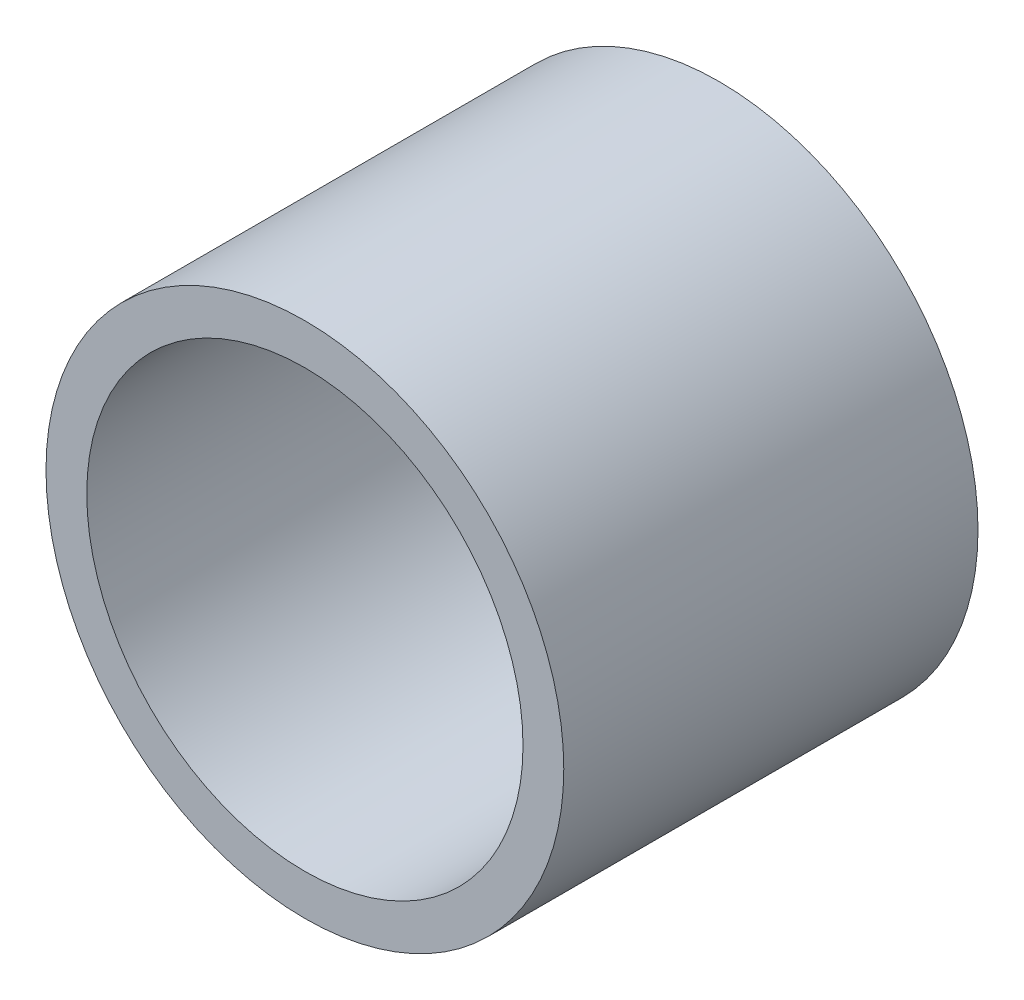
ISO-10303-21;
HEADER;
FILE_DESCRIPTION(('STEP AP214'),'2;1');
FILE_NAME('part.step','',(''),(''),'','','');
FILE_SCHEMA(('AUTOMOTIVE_DESIGN { 1 0 10303 214 1 1 1 1 }'));
ENDSEC;
DATA;
#1=APPLICATION_CONTEXT('core data for automotive mechanical design processes');
#2=APPLICATION_PROTOCOL_DEFINITION('international standard','automotive_design',2000,#1);
#3=PRODUCT_CONTEXT('',#1,'mechanical');
#4=PRODUCT('Part','Part','',(#3));
#5=PRODUCT_RELATED_PRODUCT_CATEGORY('part','',(#4));
#6=PRODUCT_DEFINITION_FORMATION('','',#4);
#7=PRODUCT_DEFINITION_CONTEXT('part definition',#1,'design');
#8=PRODUCT_DEFINITION('design','',#6,#7);
#9=PRODUCT_DEFINITION_SHAPE('','',#8);
#10=(LENGTH_UNIT() NAMED_UNIT(*) SI_UNIT(.MILLI.,.METRE.));
#11=(NAMED_UNIT(*) PLANE_ANGLE_UNIT() SI_UNIT($,.RADIAN.));
#12=(NAMED_UNIT(*) SI_UNIT($,.STERADIAN.) SOLID_ANGLE_UNIT());
#13=UNCERTAINTY_MEASURE_WITH_UNIT(LENGTH_MEASURE(1.E-05),#10,'distance_accuracy_value','');
#14=(GEOMETRIC_REPRESENTATION_CONTEXT(3) GLOBAL_UNCERTAINTY_ASSIGNED_CONTEXT((#13)) GLOBAL_UNIT_ASSIGNED_CONTEXT((#10,
#11,#12)) REPRESENTATION_CONTEXT('',''));
#15=CARTESIAN_POINT('',(0.,0.,0.));
#16=DIRECTION('',(0.,0.,1.));
#17=DIRECTION('',(1.,0.,0.));
#18=AXIS2_PLACEMENT_3D('',#15,#16,#17);
#19=CARTESIAN_POINT('',(0.,0.,25.4));
#20=DIRECTION('',(0.,0.,1.));
#21=DIRECTION('',(1.,0.,0.));
#22=AXIS2_PLACEMENT_3D('',#19,#20,#21);
#23=PLANE('',#22);
#24=CARTESIAN_POINT('',(0.,0.,25.4));
#25=DIRECTION('',(0.,0.,1.));
#26=DIRECTION('',(1.,0.,0.));
#27=AXIS2_PLACEMENT_3D('',#24,#25,#26);
#28=CIRCLE('',#27,15.875);
#29=CARTESIAN_POINT('',(15.875,0.,25.4));
#30=VERTEX_POINT('',#29);
#31=EDGE_CURVE('E11',#30,#30,#28,.T.);
#32=ORIENTED_EDGE('',*,*,#31,.T.);
#33=EDGE_LOOP('',(#32));
#34=FACE_BOUND('',#33,.T.);
#35=CARTESIAN_POINT('',(0.,0.,25.4));
#36=DIRECTION('',(0.,0.,1.));
#37=DIRECTION('',(1.,0.,0.));
#38=AXIS2_PLACEMENT_3D('',#35,#36,#37);
#39=CIRCLE('',#38,13.375);
#40=CARTESIAN_POINT('',(13.375,0.,25.4));
#41=VERTEX_POINT('',#40);
#42=EDGE_CURVE('E48',#41,#41,#39,.T.);
#43=ORIENTED_EDGE('',*,*,#42,.F.);
#44=EDGE_LOOP('',(#43));
#45=FACE_BOUND('',#44,.T.);
#46=ADVANCED_FACE('F37',(#34,#45),#23,.T.);
#47=CARTESIAN_POINT('',(0.,0.,0.));
#48=DIRECTION('',(0.,0.,1.));
#49=DIRECTION('',(1.,0.,0.));
#50=AXIS2_PLACEMENT_3D('',#47,#48,#49);
#51=PLANE('',#50);
#52=CARTESIAN_POINT('',(0.,0.,0.));
#53=DIRECTION('',(0.,0.,1.));
#54=DIRECTION('',(1.,0.,0.));
#55=AXIS2_PLACEMENT_3D('',#52,#53,#54);
#56=CIRCLE('',#55,15.875);
#57=CARTESIAN_POINT('',(15.875,0.,0.));
#58=VERTEX_POINT('',#57);
#59=EDGE_CURVE('E41',#58,#58,#56,.T.);
#60=ORIENTED_EDGE('',*,*,#59,.F.);
#61=EDGE_LOOP('',(#60));
#62=FACE_BOUND('',#61,.T.);
#63=CARTESIAN_POINT('',(0.,0.,0.));
#64=DIRECTION('',(0.,0.,1.));
#65=DIRECTION('',(1.,0.,0.));
#66=AXIS2_PLACEMENT_3D('',#63,#64,#65);
#67=CIRCLE('',#66,13.375);
#68=CARTESIAN_POINT('',(13.375,0.,0.));
#69=VERTEX_POINT('',#68);
#70=EDGE_CURVE('E50',#69,#69,#67,.T.);
#71=ORIENTED_EDGE('',*,*,#70,.T.);
#72=EDGE_LOOP('',(#71));
#73=FACE_BOUND('',#72,.T.);
#74=ADVANCED_FACE('F60',(#62,#73),#51,.F.);
#75=CARTESIAN_POINT('',(0.,0.,25.4));
#76=DIRECTION('',(0.,0.,-1.));
#77=DIRECTION('',(-1.,0.,0.));
#78=AXIS2_PLACEMENT_3D('',#75,#76,#77);
#79=CYLINDRICAL_SURFACE('',#78,15.875);
#80=ORIENTED_EDGE('',*,*,#31,.F.);
#81=EDGE_LOOP('',(#80));
#82=FACE_BOUND('',#81,.T.);
#83=ORIENTED_EDGE('',*,*,#59,.T.);
#84=EDGE_LOOP('',(#83));
#85=FACE_BOUND('',#84,.T.);
#86=ADVANCED_FACE('F39',(#82,#85),#79,.T.);
#87=CARTESIAN_POINT('',(0.,0.,25.4));
#88=DIRECTION('',(0.,0.,-1.));
#89=DIRECTION('',(-1.,0.,0.));
#90=AXIS2_PLACEMENT_3D('',#87,#88,#89);
#91=CYLINDRICAL_SURFACE('',#90,13.375);
#92=ORIENTED_EDGE('',*,*,#42,.T.);
#93=EDGE_LOOP('',(#92));
#94=FACE_BOUND('',#93,.T.);
#95=ORIENTED_EDGE('',*,*,#70,.F.);
#96=EDGE_LOOP('',(#95));
#97=FACE_BOUND('',#96,.T.);
#98=ADVANCED_FACE('F56',(#94,#97),#91,.F.);
#99=CLOSED_SHELL('',(#46,#74,#86,#98));
#100=MANIFOLD_SOLID_BREP('B2',#99);
#101=ADVANCED_BREP_SHAPE_REPRESENTATION('',(#18,#100),#14);
#102=SHAPE_DEFINITION_REPRESENTATION(#9,#101);
ENDSEC;
END-ISO-10303-21;
